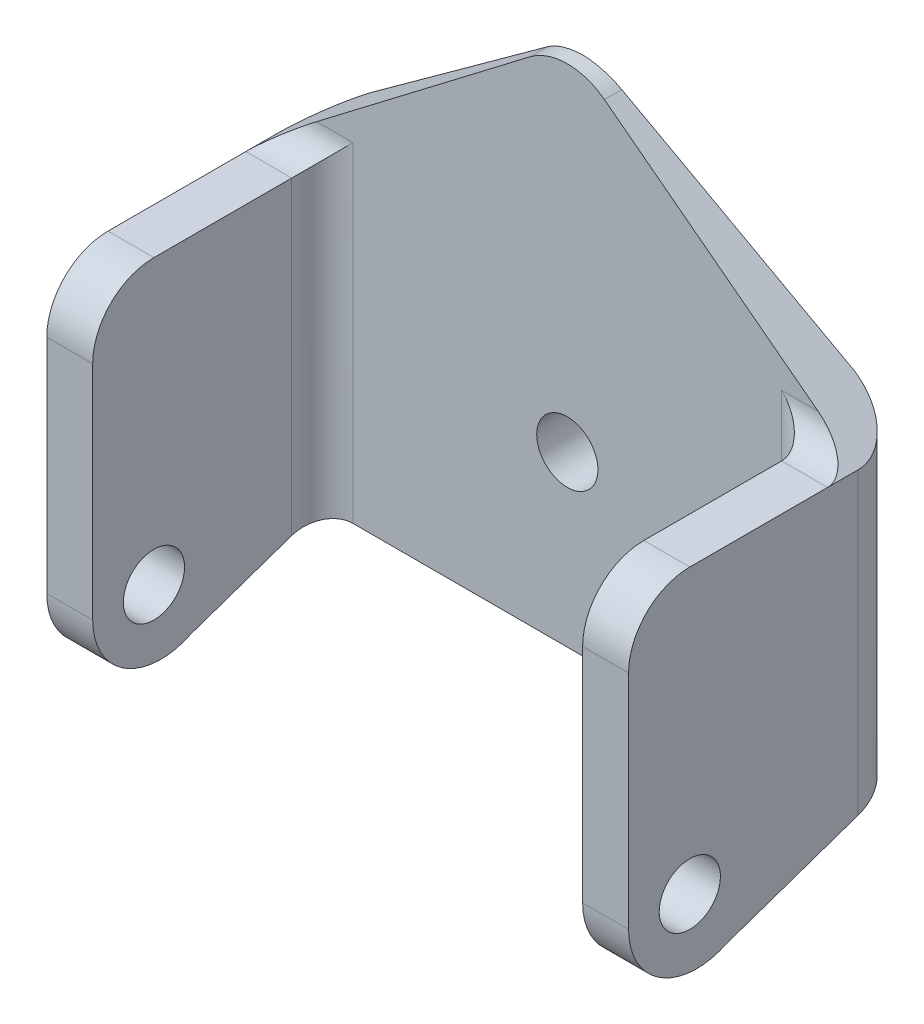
ISO-10303-21;
HEADER;
FILE_DESCRIPTION(('STEP AP214'),'2;1');
FILE_NAME('part.step','',(''),(''),'','','');
FILE_SCHEMA(('AUTOMOTIVE_DESIGN { 1 0 10303 214 1 1 1 1 }'));
ENDSEC;
DATA;
#1=APPLICATION_CONTEXT('core data for automotive mechanical design processes');
#2=APPLICATION_PROTOCOL_DEFINITION('international standard','automotive_design',2000,#1);
#3=PRODUCT_CONTEXT('',#1,'mechanical');
#4=PRODUCT('Part','Part','',(#3));
#5=PRODUCT_RELATED_PRODUCT_CATEGORY('part','',(#4));
#6=PRODUCT_DEFINITION_FORMATION('','',#4);
#7=PRODUCT_DEFINITION_CONTEXT('part definition',#1,'design');
#8=PRODUCT_DEFINITION('design','',#6,#7);
#9=PRODUCT_DEFINITION_SHAPE('','',#8);
#10=(LENGTH_UNIT() NAMED_UNIT(*) SI_UNIT(.MILLI.,.METRE.));
#11=(NAMED_UNIT(*) PLANE_ANGLE_UNIT() SI_UNIT($,.RADIAN.));
#12=(NAMED_UNIT(*) SI_UNIT($,.STERADIAN.) SOLID_ANGLE_UNIT());
#13=UNCERTAINTY_MEASURE_WITH_UNIT(LENGTH_MEASURE(1.E-05),#10,'distance_accuracy_value','');
#14=(GEOMETRIC_REPRESENTATION_CONTEXT(3) GLOBAL_UNCERTAINTY_ASSIGNED_CONTEXT((#13)) GLOBAL_UNIT_ASSIGNED_CONTEXT((#10,
#11,#12)) REPRESENTATION_CONTEXT('',''));
#15=CARTESIAN_POINT('',(0.,0.,0.));
#16=DIRECTION('',(0.,0.,1.));
#17=DIRECTION('',(1.,0.,0.));
#18=AXIS2_PLACEMENT_3D('',#15,#16,#17);
#19=CARTESIAN_POINT('',(16.,4.49999999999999,11.));
#20=DIRECTION('',(1.,0.,0.));
#21=DIRECTION('',(0.,1.,0.));
#22=AXIS2_PLACEMENT_3D('',#19,#20,#21);
#23=PLANE('',#22);
#24=CARTESIAN_POINT('',(16.,-10.,11.));
#25=DIRECTION('',(1.,0.,0.));
#26=DIRECTION('',(0.,1.,0.));
#27=AXIS2_PLACEMENT_3D('',#24,#25,#26);
#28=CIRCLE('',#27,2.);
#29=CARTESIAN_POINT('',(16.,-8.,11.));
#30=VERTEX_POINT('',#29);
#31=EDGE_CURVE('E268',#30,#30,#28,.T.);
#32=ORIENTED_EDGE('',*,*,#31,.T.);
#33=EDGE_LOOP('',(#32));
#34=FACE_BOUND('',#33,.T.);
#35=DIRECTION('',(0.,0.,1.));
#36=VECTOR('',#35,1.);
#37=CARTESIAN_POINT('',(16.,8.49999999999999,-3.));
#38=LINE('',#37,#36);
#39=CARTESIAN_POINT('',(16.,8.49999999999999,2.));
#40=VERTEX_POINT('',#39);
#41=CARTESIAN_POINT('',(16.,8.49999999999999,11.));
#42=VERTEX_POINT('',#41);
#43=EDGE_CURVE('E296',#40,#42,#38,.T.);
#44=ORIENTED_EDGE('',*,*,#43,.F.);
#45=DIRECTION('',(0.,-1.,0.));
#46=VECTOR('',#45,1.);
#47=CARTESIAN_POINT('',(16.,-11.0351212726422,2.));
#48=LINE('',#47,#46);
#49=CARTESIAN_POINT('',(16.,-11.7252021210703,2.));
#50=VERTEX_POINT('',#49);
#51=EDGE_CURVE('E324',#40,#50,#48,.T.);
#52=ORIENTED_EDGE('',*,*,#51,.T.);
#53=DIRECTION('',(0.,0.326170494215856,-0.945310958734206));
#54=VECTOR('',#53,1.);
#55=CARTESIAN_POINT('',(16.,-10.,-3.));
#56=LINE('',#55,#54);
#57=CARTESIAN_POINT('',(16.,-14.,8.59284454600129));
#58=VERTEX_POINT('',#57);
#59=EDGE_CURVE('E293',#58,#50,#56,.T.);
#60=ORIENTED_EDGE('',*,*,#59,.F.);
#61=CARTESIAN_POINT('',(16.,-10.,10.5478182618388));
#62=DIRECTION('',(1.,0.,0.));
#63=DIRECTION('',(0.,1.,0.));
#64=AXIS2_PLACEMENT_3D('',#61,#62,#63);
#65=CIRCLE('',#64,4.45218173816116);
#66=CARTESIAN_POINT('',(16.,-10.,15.));
#67=VERTEX_POINT('',#66);
#68=EDGE_CURVE('E290',#67,#58,#65,.T.);
#69=ORIENTED_EDGE('',*,*,#68,.F.);
#70=DIRECTION('',(0.,-1.,0.));
#71=VECTOR('',#70,1.);
#72=CARTESIAN_POINT('',(16.,4.49999999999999,15.));
#73=LINE('',#72,#71);
#74=CARTESIAN_POINT('',(16.,4.49999999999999,15.));
#75=VERTEX_POINT('',#74);
#76=EDGE_CURVE('E287',#75,#67,#73,.T.);
#77=ORIENTED_EDGE('',*,*,#76,.F.);
#78=CARTESIAN_POINT('',(16.,4.49999999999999,11.));
#79=DIRECTION('',(1.,0.,0.));
#80=DIRECTION('',(0.,1.,0.));
#81=AXIS2_PLACEMENT_3D('',#78,#79,#80);
#82=CIRCLE('',#81,4.);
#83=EDGE_CURVE('E284',#42,#75,#82,.T.);
#84=ORIENTED_EDGE('',*,*,#83,.F.);
#85=EDGE_LOOP('',(#44,#52,#60,#69,#77,#84));
#86=FACE_BOUND('',#85,.T.);
#87=ADVANCED_FACE('F32',(#34,#86),#23,.F.);
#88=CARTESIAN_POINT('',(0.,0.,-3.));
#89=DIRECTION('',(0.,0.,1.));
#90=DIRECTION('',(1.,0.,0.));
#91=AXIS2_PLACEMENT_3D('',#88,#89,#90);
#92=CYLINDRICAL_SURFACE('',#91,2.);
#93=CARTESIAN_POINT('',(0.,0.,0.));
#94=DIRECTION('',(0.,0.,-1.));
#95=DIRECTION('',(-1.,0.,0.));
#96=AXIS2_PLACEMENT_3D('',#93,#94,#95);
#97=CIRCLE('',#96,2.);
#98=CARTESIAN_POINT('',(-2.,0.,0.));
#99=VERTEX_POINT('',#98);
#100=EDGE_CURVE('E301',#99,#99,#97,.T.);
#101=ORIENTED_EDGE('',*,*,#100,.F.);
#102=EDGE_LOOP('',(#101));
#103=FACE_BOUND('',#102,.T.);
#104=CARTESIAN_POINT('',(0.,0.,-3.));
#105=DIRECTION('',(0.,0.,-1.));
#106=DIRECTION('',(-1.,0.,0.));
#107=AXIS2_PLACEMENT_3D('',#104,#105,#106);
#108=CIRCLE('',#107,2.);
#109=CARTESIAN_POINT('',(-2.,0.,-3.));
#110=VERTEX_POINT('',#109);
#111=EDGE_CURVE('E311',#110,#110,#108,.T.);
#112=ORIENTED_EDGE('',*,*,#111,.T.);
#113=EDGE_LOOP('',(#112));
#114=FACE_BOUND('',#113,.T.);
#115=ADVANCED_FACE('F34',(#103,#114),#92,.F.);
#116=CARTESIAN_POINT('',(0.,23.,-3.));
#117=DIRECTION('',(0.606673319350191,0.794951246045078,0.));
#118=DIRECTION('',(-0.794951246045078,0.606673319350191,0.));
#119=AXIS2_PLACEMENT_3D('',#116,#117,#118);
#120=PLANE('',#119);
#121=DIRECTION('',(0.790080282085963,-0.602956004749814,-0.11053146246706));
#122=VECTOR('',#121,1.);
#123=CARTESIAN_POINT('',(0.192613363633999,22.8530055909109,-0.821333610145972));
#124=LINE('',#123,#122);
#125=CARTESIAN_POINT('',(2.42669327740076,21.1480498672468,-1.13387921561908));
#126=VERTEX_POINT('',#125);
#127=CARTESIAN_POINT('',(15.7657480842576,10.9682448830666,-3.));
#128=VERTEX_POINT('',#127);
#129=EDGE_CURVE('E196',#126,#128,#124,.T.);
#130=ORIENTED_EDGE('',*,*,#129,.F.);
#131=DIRECTION('',(0.,0.,1.));
#132=VECTOR('',#131,1.);
#133=CARTESIAN_POINT('',(2.42669327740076,21.1480498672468,-3.));
#134=LINE('',#133,#132);
#135=CARTESIAN_POINT('',(2.42669327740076,21.1480498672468,0.));
#136=VERTEX_POINT('',#135);
#137=EDGE_CURVE('E194',#126,#136,#134,.T.);
#138=ORIENTED_EDGE('',*,*,#137,.T.);
#139=DIRECTION('',(-0.794951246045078,0.606673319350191,0.));
#140=VECTOR('',#139,1.);
#141=CARTESIAN_POINT('',(0.,23.,0.));
#142=LINE('',#141,#140);
#143=CARTESIAN_POINT('',(16.3793103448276,10.5,0.));
#144=VERTEX_POINT('',#143);
#145=EDGE_CURVE('E309',#144,#136,#142,.T.);
#146=ORIENTED_EDGE('',*,*,#145,.F.);
#147=CARTESIAN_POINT('',(16.3793103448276,10.5,2.));
#148=DIRECTION('',(0.606673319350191,0.794951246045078,0.));
#149=DIRECTION('',(0.794951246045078,-0.606673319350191,0.));
#150=AXIS2_PLACEMENT_3D('',#147,#148,#149);
#151=ELLIPSE('',#150,3.29666714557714,2.);
#152=CARTESIAN_POINT('',(19.,8.49999999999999,2.));
#153=VERTEX_POINT('',#152);
#154=EDGE_CURVE('E373',#144,#153,#151,.F.);
#155=ORIENTED_EDGE('',*,*,#154,.T.);
#156=DIRECTION('',(0.,0.,1.));
#157=VECTOR('',#156,1.);
#158=CARTESIAN_POINT('',(19.,8.5,-3.));
#159=LINE('',#158,#157);
#160=CARTESIAN_POINT('',(19.,8.49999999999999,0.));
#161=VERTEX_POINT('',#160);
#162=EDGE_CURVE('E187',#161,#153,#159,.T.);
#163=ORIENTED_EDGE('',*,*,#162,.F.);
#164=CARTESIAN_POINT('',(16.,10.7894736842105,0.));
#165=DIRECTION('',(0.606673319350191,0.794951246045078,0.));
#166=DIRECTION('',(-0.794951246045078,0.606673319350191,0.));
#167=AXIS2_PLACEMENT_3D('',#164,#165,#166);
#168=ELLIPSE('',#167,3.77381633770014,3.);
#169=CARTESIAN_POINT('',(16.,10.7894736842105,-3.));
#170=VERTEX_POINT('',#169);
#171=EDGE_CURVE('E356',#161,#170,#168,.T.);
#172=ORIENTED_EDGE('',*,*,#171,.T.);
#173=DIRECTION('',(-0.794951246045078,0.606673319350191,0.));
#174=VECTOR('',#173,1.);
#175=CARTESIAN_POINT('',(0.,23.,-3.));
#176=LINE('',#175,#174);
#177=EDGE_CURVE('E204',#170,#128,#176,.T.);
#178=ORIENTED_EDGE('',*,*,#177,.T.);
#179=EDGE_LOOP('',(#130,#138,#146,#155,#163,#172,#178));
#180=FACE_BOUND('',#179,.T.);
#181=ADVANCED_FACE('F200',(#180),#120,.T.);
#182=CARTESIAN_POINT('',(19.,-10.,-3.));
#183=DIRECTION('',(1.,0.,0.));
#184=DIRECTION('',(0.,1.,0.));
#185=AXIS2_PLACEMENT_3D('',#182,#183,#184);
#186=PLANE('',#185);
#187=DIRECTION('',(0.,0.326170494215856,-0.945310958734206));
#188=VECTOR('',#187,1.);
#189=CARTESIAN_POINT('',(19.,-10.,-3.));
#190=LINE('',#189,#188);
#191=CARTESIAN_POINT('',(19.,-14.,8.59284454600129));
#192=VERTEX_POINT('',#191);
#193=CARTESIAN_POINT('',(19.,-11.0351212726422,0.));
#194=VERTEX_POINT('',#193);
#195=EDGE_CURVE('E280',#192,#194,#190,.T.);
#196=ORIENTED_EDGE('',*,*,#195,.T.);
#197=DIRECTION('',(0.,1.,0.));
#198=VECTOR('',#197,1.);
#199=CARTESIAN_POINT('',(19.,-10.,0.));
#200=LINE('',#199,#198);
#201=EDGE_CURVE('E353',#194,#161,#200,.T.);
#202=ORIENTED_EDGE('',*,*,#201,.T.);
#203=ORIENTED_EDGE('',*,*,#162,.T.);
#204=DIRECTION('',(0.,0.,1.));
#205=VECTOR('',#204,1.);
#206=CARTESIAN_POINT('',(19.,8.49999999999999,-3.));
#207=LINE('',#206,#205);
#208=CARTESIAN_POINT('',(19.,8.49999999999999,11.));
#209=VERTEX_POINT('',#208);
#210=EDGE_CURVE('E56',#153,#209,#207,.T.);
#211=ORIENTED_EDGE('',*,*,#210,.T.);
#212=CARTESIAN_POINT('',(19.,4.49999999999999,11.));
#213=DIRECTION('',(1.,0.,0.));
#214=DIRECTION('',(0.,1.,0.));
#215=AXIS2_PLACEMENT_3D('',#212,#213,#214);
#216=CIRCLE('',#215,4.);
#217=CARTESIAN_POINT('',(19.,4.49999999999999,15.));
#218=VERTEX_POINT('',#217);
#219=EDGE_CURVE('E271',#209,#218,#216,.T.);
#220=ORIENTED_EDGE('',*,*,#219,.T.);
#221=DIRECTION('',(0.,-1.,0.));
#222=VECTOR('',#221,1.);
#223=CARTESIAN_POINT('',(19.,4.49999999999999,15.));
#224=LINE('',#223,#222);
#225=CARTESIAN_POINT('',(19.,-10.,15.));
#226=VERTEX_POINT('',#225);
#227=EDGE_CURVE('E274',#218,#226,#224,.T.);
#228=ORIENTED_EDGE('',*,*,#227,.T.);
#229=CARTESIAN_POINT('',(19.,-10.,10.5478182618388));
#230=DIRECTION('',(1.,0.,0.));
#231=DIRECTION('',(0.,1.,0.));
#232=AXIS2_PLACEMENT_3D('',#229,#230,#231);
#233=CIRCLE('',#232,4.45218173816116);
#234=EDGE_CURVE('E277',#226,#192,#233,.T.);
#235=ORIENTED_EDGE('',*,*,#234,.T.);
#236=EDGE_LOOP('',(#196,#202,#203,#211,#220,#228,#235));
#237=FACE_BOUND('',#236,.T.);
#238=CARTESIAN_POINT('',(19.,-10.,11.));
#239=DIRECTION('',(1.,0.,0.));
#240=DIRECTION('',(0.,1.,0.));
#241=AXIS2_PLACEMENT_3D('',#238,#239,#240);
#242=CIRCLE('',#241,2.);
#243=CARTESIAN_POINT('',(19.,-8.,11.));
#244=VERTEX_POINT('',#243);
#245=EDGE_CURVE('E265',#244,#244,#242,.T.);
#246=ORIENTED_EDGE('',*,*,#245,.F.);
#247=EDGE_LOOP('',(#246));
#248=FACE_BOUND('',#247,.T.);
#249=ADVANCED_FACE('F384',(#237,#248),#186,.T.);
#250=CARTESIAN_POINT('',(0.,0.,-3.));
#251=DIRECTION('',(0.,0.,-1.));
#252=DIRECTION('',(-1.,0.,0.));
#253=AXIS2_PLACEMENT_3D('',#250,#251,#252);
#254=PLANE('',#253);
#255=DIRECTION('',(-1.,0.,0.));
#256=VECTOR('',#255,1.);
#257=CARTESIAN_POINT('',(0.,10.9682448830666,-3.));
#258=LINE('',#257,#256);
#259=CARTESIAN_POINT('',(-15.7657480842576,10.9682448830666,-3.));
#260=VERTEX_POINT('',#259);
#261=EDGE_CURVE('E207',#128,#260,#258,.T.);
#262=ORIENTED_EDGE('',*,*,#261,.F.);
#263=ORIENTED_EDGE('',*,*,#177,.F.);
#264=DIRECTION('',(0.,1.,0.));
#265=VECTOR('',#264,1.);
#266=CARTESIAN_POINT('',(16.,0.,-3.));
#267=LINE('',#266,#265);
#268=CARTESIAN_POINT('',(16.,-10.,-3.));
#269=VERTEX_POINT('',#268);
#270=EDGE_CURVE('E339',#170,#269,#267,.F.);
#271=ORIENTED_EDGE('',*,*,#270,.T.);
#272=DIRECTION('',(1.,0.,0.));
#273=VECTOR('',#272,1.);
#274=CARTESIAN_POINT('',(0.,-10.,-3.));
#275=LINE('',#274,#273);
#276=CARTESIAN_POINT('',(-16.,-9.99999999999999,-3.));
#277=VERTEX_POINT('',#276);
#278=EDGE_CURVE('E314',#277,#269,#275,.T.);
#279=ORIENTED_EDGE('',*,*,#278,.F.);
#280=DIRECTION('',(0.,1.,0.));
#281=VECTOR('',#280,1.);
#282=CARTESIAN_POINT('',(-16.,0.,-3.));
#283=LINE('',#282,#281);
#284=CARTESIAN_POINT('',(-16.,10.7894736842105,-3.));
#285=VERTEX_POINT('',#284);
#286=EDGE_CURVE('E341',#277,#285,#283,.T.);
#287=ORIENTED_EDGE('',*,*,#286,.T.);
#288=DIRECTION('',(0.794951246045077,0.606673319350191,0.));
#289=VECTOR('',#288,1.);
#290=CARTESIAN_POINT('',(0.,23.,-3.));
#291=LINE('',#290,#289);
#292=EDGE_CURVE('E259',#285,#260,#291,.T.);
#293=ORIENTED_EDGE('',*,*,#292,.T.);
#294=EDGE_LOOP('',(#262,#263,#271,#279,#287,#293));
#295=FACE_BOUND('',#294,.T.);
#296=ORIENTED_EDGE('',*,*,#111,.F.);
#297=EDGE_LOOP('',(#296));
#298=FACE_BOUND('',#297,.T.);
#299=ADVANCED_FACE('F433',(#295,#298),#254,.T.);
#300=CARTESIAN_POINT('',(0.,0.,0.));
#301=DIRECTION('',(0.,0.,-1.));
#302=DIRECTION('',(-1.,0.,0.));
#303=AXIS2_PLACEMENT_3D('',#300,#301,#302);
#304=PLANE('',#303);
#305=ORIENTED_EDGE('',*,*,#100,.T.);
#306=EDGE_LOOP('',(#305));
#307=FACE_BOUND('',#306,.T.);
#308=DIRECTION('',(0.794951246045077,0.606673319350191,0.));
#309=VECTOR('',#308,1.);
#310=CARTESIAN_POINT('',(0.,23.,0.));
#311=LINE('',#310,#309);
#312=CARTESIAN_POINT('',(-16.3793103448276,10.5,0.));
#313=VERTEX_POINT('',#312);
#314=CARTESIAN_POINT('',(-2.42669327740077,21.1480498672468,0.));
#315=VERTEX_POINT('',#314);
#316=EDGE_CURVE('E252',#313,#315,#311,.T.);
#317=ORIENTED_EDGE('',*,*,#316,.F.);
#318=DIRECTION('',(-1.,0.,0.));
#319=VECTOR('',#318,1.);
#320=CARTESIAN_POINT('',(0.,10.5,0.));
#321=LINE('',#320,#319);
#322=CARTESIAN_POINT('',(-14.,10.5,0.));
#323=VERTEX_POINT('',#322);
#324=EDGE_CURVE('E364',#313,#323,#321,.F.);
#325=ORIENTED_EDGE('',*,*,#324,.T.);
#326=DIRECTION('',(0.,-1.,0.));
#327=VECTOR('',#326,1.);
#328=CARTESIAN_POINT('',(-14.,-11.0351212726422,0.));
#329=LINE('',#328,#327);
#330=CARTESIAN_POINT('',(-14.,-11.0351212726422,0.));
#331=VERTEX_POINT('',#330);
#332=EDGE_CURVE('E327',#323,#331,#329,.T.);
#333=ORIENTED_EDGE('',*,*,#332,.T.);
#334=DIRECTION('',(-1.,0.,0.));
#335=VECTOR('',#334,1.);
#336=CARTESIAN_POINT('',(0.,-11.0351212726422,0.));
#337=LINE('',#336,#335);
#338=CARTESIAN_POINT('',(14.,-11.0351212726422,0.));
#339=VERTEX_POINT('',#338);
#340=EDGE_CURVE('E262',#339,#331,#337,.T.);
#341=ORIENTED_EDGE('',*,*,#340,.F.);
#342=DIRECTION('',(0.,-1.,0.));
#343=VECTOR('',#342,1.);
#344=CARTESIAN_POINT('',(14.,8.49999999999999,0.));
#345=LINE('',#344,#343);
#346=CARTESIAN_POINT('',(14.,10.5,0.));
#347=VERTEX_POINT('',#346);
#348=EDGE_CURVE('E330',#339,#347,#345,.F.);
#349=ORIENTED_EDGE('',*,*,#348,.T.);
#350=DIRECTION('',(1.,0.,0.));
#351=VECTOR('',#350,1.);
#352=CARTESIAN_POINT('',(0.,10.5,0.));
#353=LINE('',#352,#351);
#354=EDGE_CURVE('E361',#347,#144,#353,.T.);
#355=ORIENTED_EDGE('',*,*,#354,.T.);
#356=ORIENTED_EDGE('',*,*,#145,.T.);
#357=CARTESIAN_POINT('',(0.,17.9682448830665,0.));
#358=DIRECTION('',(0.,0.,-1.));
#359=DIRECTION('',(-1.,0.,0.));
#360=AXIS2_PLACEMENT_3D('',#357,#358,#359);
#361=CIRCLE('',#360,4.);
#362=EDGE_CURVE('E319',#136,#315,#361,.F.);
#363=ORIENTED_EDGE('',*,*,#362,.T.);
#364=EDGE_LOOP('',(#317,#325,#333,#341,#349,#355,#356,#363));
#365=FACE_BOUND('',#364,.T.);
#366=ADVANCED_FACE('F408',(#307,#365),#304,.F.);
#367=CARTESIAN_POINT('',(16.,8.49999999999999,-3.));
#368=DIRECTION('',(0.,1.,0.));
#369=DIRECTION('',(-1.,0.,0.));
#370=AXIS2_PLACEMENT_3D('',#367,#368,#369);
#371=PLANE('',#370);
#372=ORIENTED_EDGE('',*,*,#210,.F.);
#373=DIRECTION('',(1.,0.,0.));
#374=VECTOR('',#373,1.);
#375=CARTESIAN_POINT('',(16.,8.49999999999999,2.));
#376=LINE('',#375,#374);
#377=EDGE_CURVE('E367',#153,#40,#376,.F.);
#378=ORIENTED_EDGE('',*,*,#377,.T.);
#379=ORIENTED_EDGE('',*,*,#43,.T.);
#380=DIRECTION('',(1.,0.,0.));
#381=VECTOR('',#380,1.);
#382=CARTESIAN_POINT('',(16.,8.49999999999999,11.));
#383=LINE('',#382,#381);
#384=EDGE_CURVE('E299',#42,#209,#383,.T.);
#385=ORIENTED_EDGE('',*,*,#384,.T.);
#386=EDGE_LOOP('',(#372,#378,#379,#385));
#387=FACE_BOUND('',#386,.T.);
#388=ADVANCED_FACE('F393',(#387),#371,.T.);
#389=CARTESIAN_POINT('',(16.,4.49999999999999,11.));
#390=DIRECTION('',(1.,0.,0.));
#391=DIRECTION('',(0.,1.,0.));
#392=AXIS2_PLACEMENT_3D('',#389,#390,#391);
#393=CYLINDRICAL_SURFACE('',#392,4.);
#394=ORIENTED_EDGE('',*,*,#219,.F.);
#395=ORIENTED_EDGE('',*,*,#384,.F.);
#396=ORIENTED_EDGE('',*,*,#83,.T.);
#397=DIRECTION('',(1.,0.,0.));
#398=VECTOR('',#397,1.);
#399=CARTESIAN_POINT('',(16.,4.49999999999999,15.));
#400=LINE('',#399,#398);
#401=EDGE_CURVE('E298',#75,#218,#400,.T.);
#402=ORIENTED_EDGE('',*,*,#401,.T.);
#403=EDGE_LOOP('',(#394,#395,#396,#402));
#404=FACE_BOUND('',#403,.T.);
#405=ADVANCED_FACE('F476',(#404),#393,.T.);
#406=CARTESIAN_POINT('',(16.,-10.,-3.));
#407=DIRECTION('',(0.,-0.945310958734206,-0.326170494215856));
#408=DIRECTION('',(0.,0.326170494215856,-0.945310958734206));
#409=AXIS2_PLACEMENT_3D('',#406,#407,#408);
#410=PLANE('',#409);
#411=DIRECTION('',(0.,0.326170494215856,-0.945310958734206));
#412=VECTOR('',#411,1.);
#413=CARTESIAN_POINT('',(-19.,-10.,-3.));
#414=LINE('',#413,#412);
#415=CARTESIAN_POINT('',(-19.,-14.,8.59284454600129));
#416=VERTEX_POINT('',#415);
#417=CARTESIAN_POINT('',(-19.,-11.0351212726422,0.));
#418=VERTEX_POINT('',#417);
#419=EDGE_CURVE('E229',#416,#418,#414,.T.);
#420=ORIENTED_EDGE('',*,*,#419,.T.);
#421=CARTESIAN_POINT('',(-16.,-11.0351212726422,0.));
#422=DIRECTION('',(0.,-0.945310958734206,-0.326170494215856));
#423=DIRECTION('',(0.,0.326170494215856,-0.945310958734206));
#424=AXIS2_PLACEMENT_3D('',#421,#422,#423);
#425=ELLIPSE('',#424,3.17355889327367,3.);
#426=EDGE_CURVE('E351',#418,#277,#425,.T.);
#427=ORIENTED_EDGE('',*,*,#426,.T.);
#428=ORIENTED_EDGE('',*,*,#278,.T.);
#429=CARTESIAN_POINT('',(16.,-11.0351212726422,0.));
#430=DIRECTION('',(0.,-0.945310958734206,-0.326170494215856));
#431=DIRECTION('',(0.,0.326170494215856,-0.945310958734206));
#432=AXIS2_PLACEMENT_3D('',#429,#430,#431);
#433=ELLIPSE('',#432,3.17355889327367,3.);
#434=EDGE_CURVE('E349',#269,#194,#433,.T.);
#435=ORIENTED_EDGE('',*,*,#434,.T.);
#436=ORIENTED_EDGE('',*,*,#195,.F.);
#437=DIRECTION('',(1.,0.,0.));
#438=VECTOR('',#437,1.);
#439=CARTESIAN_POINT('',(16.,-14.,8.59284454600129));
#440=LINE('',#439,#438);
#441=EDGE_CURVE('E302',#58,#192,#440,.T.);
#442=ORIENTED_EDGE('',*,*,#441,.F.);
#443=ORIENTED_EDGE('',*,*,#59,.T.);
#444=CARTESIAN_POINT('',(14.,-11.7252021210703,2.));
#445=DIRECTION('',(0.,-0.945310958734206,-0.326170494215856));
#446=DIRECTION('',(0.,0.326170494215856,-0.945310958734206));
#447=AXIS2_PLACEMENT_3D('',#444,#445,#446);
#448=ELLIPSE('',#447,2.11570592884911,2.);
#449=EDGE_CURVE('E335',#50,#339,#448,.F.);
#450=ORIENTED_EDGE('',*,*,#449,.T.);
#451=ORIENTED_EDGE('',*,*,#340,.T.);
#452=CARTESIAN_POINT('',(-14.,-11.7252021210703,2.));
#453=DIRECTION('',(0.,-0.945310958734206,-0.326170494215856));
#454=DIRECTION('',(0.,0.326170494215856,-0.945310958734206));
#455=AXIS2_PLACEMENT_3D('',#452,#453,#454);
#456=ELLIPSE('',#455,2.11570592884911,2.);
#457=CARTESIAN_POINT('',(-16.,-11.7252021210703,2.));
#458=VERTEX_POINT('',#457);
#459=EDGE_CURVE('E337',#331,#458,#456,.F.);
#460=ORIENTED_EDGE('',*,*,#459,.T.);
#461=DIRECTION('',(0.,0.326170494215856,-0.945310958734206));
#462=VECTOR('',#461,1.);
#463=CARTESIAN_POINT('',(-16.,-10.,-3.));
#464=LINE('',#463,#462);
#465=CARTESIAN_POINT('',(-16.,-14.,8.59284454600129));
#466=VERTEX_POINT('',#465);
#467=EDGE_CURVE('E243',#466,#458,#464,.T.);
#468=ORIENTED_EDGE('',*,*,#467,.F.);
#469=DIRECTION('',(-1.,0.,0.));
#470=VECTOR('',#469,1.);
#471=CARTESIAN_POINT('',(-16.,-14.,8.59284454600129));
#472=LINE('',#471,#470);
#473=EDGE_CURVE('E253',#466,#416,#472,.T.);
#474=ORIENTED_EDGE('',*,*,#473,.T.);
#475=EDGE_LOOP('',(#420,#427,#428,#435,#436,#442,#443,#450,#451,#460,#468,#474));
#476=FACE_BOUND('',#475,.T.);
#477=ADVANCED_FACE('F405',(#476),#410,.T.);
#478=CARTESIAN_POINT('',(16.,-10.,10.5478182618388));
#479=DIRECTION('',(1.,0.,0.));
#480=DIRECTION('',(0.,1.,0.));
#481=AXIS2_PLACEMENT_3D('',#478,#479,#480);
#482=CYLINDRICAL_SURFACE('',#481,4.45218173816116);
#483=ORIENTED_EDGE('',*,*,#234,.F.);
#484=DIRECTION('',(1.,0.,0.));
#485=VECTOR('',#484,1.);
#486=CARTESIAN_POINT('',(16.,-10.,15.));
#487=LINE('',#486,#485);
#488=EDGE_CURVE('E304',#67,#226,#487,.T.);
#489=ORIENTED_EDGE('',*,*,#488,.F.);
#490=ORIENTED_EDGE('',*,*,#68,.T.);
#491=ORIENTED_EDGE('',*,*,#441,.T.);
#492=EDGE_LOOP('',(#483,#489,#490,#491));
#493=FACE_BOUND('',#492,.T.);
#494=ADVANCED_FACE('F479',(#493),#482,.T.);
#495=CARTESIAN_POINT('',(16.,4.49999999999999,15.));
#496=DIRECTION('',(0.,0.,1.));
#497=DIRECTION('',(0.,-1.,0.));
#498=AXIS2_PLACEMENT_3D('',#495,#496,#497);
#499=PLANE('',#498);
#500=ORIENTED_EDGE('',*,*,#227,.F.);
#501=ORIENTED_EDGE('',*,*,#401,.F.);
#502=ORIENTED_EDGE('',*,*,#76,.T.);
#503=ORIENTED_EDGE('',*,*,#488,.T.);
#504=EDGE_LOOP('',(#500,#501,#502,#503));
#505=FACE_BOUND('',#504,.T.);
#506=ADVANCED_FACE('F482',(#505),#499,.T.);
#507=CARTESIAN_POINT('',(16.,-10.,11.));
#508=DIRECTION('',(1.,0.,0.));
#509=DIRECTION('',(0.,1.,0.));
#510=AXIS2_PLACEMENT_3D('',#507,#508,#509);
#511=CYLINDRICAL_SURFACE('',#510,2.);
#512=ORIENTED_EDGE('',*,*,#31,.F.);
#513=EDGE_LOOP('',(#512));
#514=FACE_BOUND('',#513,.T.);
#515=ORIENTED_EDGE('',*,*,#245,.T.);
#516=EDGE_LOOP('',(#515));
#517=FACE_BOUND('',#516,.T.);
#518=ADVANCED_FACE('F472',(#514,#517),#511,.F.);
#519=CARTESIAN_POINT('',(-16.,4.49999999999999,11.));
#520=DIRECTION('',(-1.,0.,0.));
#521=DIRECTION('',(0.,1.,0.));
#522=AXIS2_PLACEMENT_3D('',#519,#520,#521);
#523=PLANE('',#522);
#524=CARTESIAN_POINT('',(-16.,-10.,11.));
#525=DIRECTION('',(1.,0.,0.));
#526=DIRECTION('',(0.,1.,0.));
#527=AXIS2_PLACEMENT_3D('',#524,#525,#526);
#528=CIRCLE('',#527,2.);
#529=CARTESIAN_POINT('',(-16.,-8.00000000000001,11.));
#530=VERTEX_POINT('',#529);
#531=EDGE_CURVE('E213',#530,#530,#528,.T.);
#532=ORIENTED_EDGE('',*,*,#531,.F.);
#533=EDGE_LOOP('',(#532));
#534=FACE_BOUND('',#533,.T.);
#535=ORIENTED_EDGE('',*,*,#467,.T.);
#536=DIRECTION('',(0.,-1.,0.));
#537=VECTOR('',#536,1.);
#538=CARTESIAN_POINT('',(-16.,8.49999999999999,2.));
#539=LINE('',#538,#537);
#540=CARTESIAN_POINT('',(-16.,8.49999999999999,2.));
#541=VERTEX_POINT('',#540);
#542=EDGE_CURVE('E332',#458,#541,#539,.F.);
#543=ORIENTED_EDGE('',*,*,#542,.T.);
#544=DIRECTION('',(0.,0.,1.));
#545=VECTOR('',#544,1.);
#546=CARTESIAN_POINT('',(-16.,8.49999999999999,-3.));
#547=LINE('',#546,#545);
#548=CARTESIAN_POINT('',(-16.,8.49999999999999,11.));
#549=VERTEX_POINT('',#548);
#550=EDGE_CURVE('E246',#541,#549,#547,.T.);
#551=ORIENTED_EDGE('',*,*,#550,.T.);
#552=CARTESIAN_POINT('',(-16.,4.49999999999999,11.));
#553=DIRECTION('',(1.,0.,0.));
#554=DIRECTION('',(0.,1.,0.));
#555=AXIS2_PLACEMENT_3D('',#552,#553,#554);
#556=CIRCLE('',#555,4.);
#557=CARTESIAN_POINT('',(-16.,4.49999999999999,15.));
#558=VERTEX_POINT('',#557);
#559=EDGE_CURVE('E234',#549,#558,#556,.T.);
#560=ORIENTED_EDGE('',*,*,#559,.T.);
#561=DIRECTION('',(0.,-1.,0.));
#562=VECTOR('',#561,1.);
#563=CARTESIAN_POINT('',(-16.,4.49999999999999,15.));
#564=LINE('',#563,#562);
#565=CARTESIAN_POINT('',(-16.,-10.,15.));
#566=VERTEX_POINT('',#565);
#567=EDGE_CURVE('E237',#558,#566,#564,.T.);
#568=ORIENTED_EDGE('',*,*,#567,.T.);
#569=CARTESIAN_POINT('',(-16.,-10.,10.5478182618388));
#570=DIRECTION('',(1.,0.,0.));
#571=DIRECTION('',(0.,1.,0.));
#572=AXIS2_PLACEMENT_3D('',#569,#570,#571);
#573=CIRCLE('',#572,4.45218173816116);
#574=EDGE_CURVE('E240',#566,#466,#573,.T.);
#575=ORIENTED_EDGE('',*,*,#574,.T.);
#576=EDGE_LOOP('',(#535,#543,#551,#560,#568,#575));
#577=FACE_BOUND('',#576,.T.);
#578=ADVANCED_FACE('F416',(#534,#577),#523,.F.);
#579=CARTESIAN_POINT('',(0.,23.,-3.));
#580=DIRECTION('',(-0.606673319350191,0.794951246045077,0.));
#581=DIRECTION('',(0.794951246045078,0.606673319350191,0.));
#582=AXIS2_PLACEMENT_3D('',#579,#580,#581);
#583=PLANE('',#582);
#584=DIRECTION('',(0.790080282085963,0.602956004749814,0.11053146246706));
#585=VECTOR('',#584,1.);
#586=CARTESIAN_POINT('',(-0.192613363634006,22.8530055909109,-0.821333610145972));
#587=LINE('',#586,#585);
#588=CARTESIAN_POINT('',(-2.42669327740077,21.1480498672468,-1.13387921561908));
#589=VERTEX_POINT('',#588);
#590=EDGE_CURVE('E48',#260,#589,#587,.T.);
#591=ORIENTED_EDGE('',*,*,#590,.F.);
#592=ORIENTED_EDGE('',*,*,#292,.F.);
#593=CARTESIAN_POINT('',(-16.,10.7894736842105,0.));
#594=DIRECTION('',(-0.606673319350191,0.794951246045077,0.));
#595=DIRECTION('',(0.794951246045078,0.606673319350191,0.));
#596=AXIS2_PLACEMENT_3D('',#593,#594,#595);
#597=ELLIPSE('',#596,3.77381633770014,3.);
#598=CARTESIAN_POINT('',(-19.,8.49999999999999,0.));
#599=VERTEX_POINT('',#598);
#600=EDGE_CURVE('E344',#285,#599,#597,.T.);
#601=ORIENTED_EDGE('',*,*,#600,.T.);
#602=DIRECTION('',(0.,0.,1.));
#603=VECTOR('',#602,1.);
#604=CARTESIAN_POINT('',(-19.,8.49999999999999,-3.));
#605=LINE('',#604,#603);
#606=CARTESIAN_POINT('',(-19.,8.49999999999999,1.99999699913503));
#607=VERTEX_POINT('',#606);
#608=EDGE_CURVE('E378',#599,#607,#605,.T.);
#609=ORIENTED_EDGE('',*,*,#608,.T.);
#610=CARTESIAN_POINT('',(-16.3793103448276,10.5,2.));
#611=DIRECTION('',(-0.606673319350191,0.794951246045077,0.));
#612=DIRECTION('',(-0.794951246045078,-0.606673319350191,0.));
#613=AXIS2_PLACEMENT_3D('',#610,#611,#612);
#614=ELLIPSE('',#613,3.29666714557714,2.);
#615=EDGE_CURVE('E369',#607,#313,#614,.F.);
#616=ORIENTED_EDGE('',*,*,#615,.T.);
#617=ORIENTED_EDGE('',*,*,#316,.T.);
#618=DIRECTION('',(0.,0.,1.));
#619=VECTOR('',#618,1.);
#620=CARTESIAN_POINT('',(-2.42669327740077,21.1480498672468,-3.));
#621=LINE('',#620,#619);
#622=EDGE_CURVE('E322',#315,#589,#621,.F.);
#623=ORIENTED_EDGE('',*,*,#622,.T.);
#624=EDGE_LOOP('',(#591,#592,#601,#609,#616,#617,#623));
#625=FACE_BOUND('',#624,.T.);
#626=ADVANCED_FACE('F436',(#625),#583,.T.);
#627=CARTESIAN_POINT('',(-19.,-10.,-3.));
#628=DIRECTION('',(-1.,0.,0.));
#629=DIRECTION('',(0.,1.,0.));
#630=AXIS2_PLACEMENT_3D('',#627,#628,#629);
#631=PLANE('',#630);
#632=DIRECTION('',(0.,0.,1.));
#633=VECTOR('',#632,1.);
#634=CARTESIAN_POINT('',(-19.,8.49999999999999,-3.));
#635=LINE('',#634,#633);
#636=CARTESIAN_POINT('',(-19.,8.49999999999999,11.));
#637=VERTEX_POINT('',#636);
#638=EDGE_CURVE('E232',#607,#637,#635,.T.);
#639=ORIENTED_EDGE('',*,*,#638,.F.);
#640=ORIENTED_EDGE('',*,*,#608,.F.);
#641=DIRECTION('',(0.,1.,0.));
#642=VECTOR('',#641,1.);
#643=CARTESIAN_POINT('',(-19.,-10.,0.));
#644=LINE('',#643,#642);
#645=EDGE_CURVE('E347',#599,#418,#644,.F.);
#646=ORIENTED_EDGE('',*,*,#645,.T.);
#647=ORIENTED_EDGE('',*,*,#419,.F.);
#648=CARTESIAN_POINT('',(-19.,-10.,10.5478182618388));
#649=DIRECTION('',(1.,0.,0.));
#650=DIRECTION('',(0.,1.,0.));
#651=AXIS2_PLACEMENT_3D('',#648,#649,#650);
#652=CIRCLE('',#651,4.45218173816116);
#653=CARTESIAN_POINT('',(-19.,-10.,15.));
#654=VERTEX_POINT('',#653);
#655=EDGE_CURVE('E226',#654,#416,#652,.T.);
#656=ORIENTED_EDGE('',*,*,#655,.F.);
#657=DIRECTION('',(0.,-1.,0.));
#658=VECTOR('',#657,1.);
#659=CARTESIAN_POINT('',(-19.,4.49999999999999,15.));
#660=LINE('',#659,#658);
#661=CARTESIAN_POINT('',(-19.,4.49999999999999,15.));
#662=VERTEX_POINT('',#661);
#663=EDGE_CURVE('E223',#662,#654,#660,.T.);
#664=ORIENTED_EDGE('',*,*,#663,.F.);
#665=CARTESIAN_POINT('',(-19.,4.49999999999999,11.));
#666=DIRECTION('',(1.,0.,0.));
#667=DIRECTION('',(0.,1.,0.));
#668=AXIS2_PLACEMENT_3D('',#665,#666,#667);
#669=CIRCLE('',#668,4.);
#670=EDGE_CURVE('E220',#637,#662,#669,.T.);
#671=ORIENTED_EDGE('',*,*,#670,.F.);
#672=EDGE_LOOP('',(#639,#640,#646,#647,#656,#664,#671));
#673=FACE_BOUND('',#672,.T.);
#674=CARTESIAN_POINT('',(-19.,-10.,11.));
#675=DIRECTION('',(1.,0.,0.));
#676=DIRECTION('',(0.,1.,0.));
#677=AXIS2_PLACEMENT_3D('',#674,#675,#676);
#678=CIRCLE('',#677,2.);
#679=CARTESIAN_POINT('',(-19.,-8.00000000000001,11.));
#680=VERTEX_POINT('',#679);
#681=EDGE_CURVE('E206',#680,#680,#678,.T.);
#682=ORIENTED_EDGE('',*,*,#681,.T.);
#683=EDGE_LOOP('',(#682));
#684=FACE_BOUND('',#683,.T.);
#685=ADVANCED_FACE('F445',(#673,#684),#631,.T.);
#686=CARTESIAN_POINT('',(-16.,8.49999999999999,-3.));
#687=DIRECTION('',(0.,1.,0.));
#688=DIRECTION('',(1.,0.,0.));
#689=AXIS2_PLACEMENT_3D('',#686,#687,#688);
#690=PLANE('',#689);
#691=ORIENTED_EDGE('',*,*,#550,.F.);
#692=DIRECTION('',(-1.,0.,0.));
#693=VECTOR('',#692,1.);
#694=CARTESIAN_POINT('',(-16.,8.49999999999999,2.));
#695=LINE('',#694,#693);
#696=EDGE_CURVE('E358',#541,#607,#695,.T.);
#697=ORIENTED_EDGE('',*,*,#696,.T.);
#698=ORIENTED_EDGE('',*,*,#638,.T.);
#699=DIRECTION('',(-1.,0.,0.));
#700=VECTOR('',#699,1.);
#701=CARTESIAN_POINT('',(-16.,8.49999999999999,11.));
#702=LINE('',#701,#700);
#703=EDGE_CURVE('E249',#549,#637,#702,.T.);
#704=ORIENTED_EDGE('',*,*,#703,.F.);
#705=EDGE_LOOP('',(#691,#697,#698,#704));
#706=FACE_BOUND('',#705,.T.);
#707=ADVANCED_FACE('F442',(#706),#690,.T.);
#708=CARTESIAN_POINT('',(-16.,4.49999999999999,11.));
#709=DIRECTION('',(-1.,0.,0.));
#710=DIRECTION('',(0.,1.,0.));
#711=AXIS2_PLACEMENT_3D('',#708,#709,#710);
#712=CYLINDRICAL_SURFACE('',#711,4.);
#713=ORIENTED_EDGE('',*,*,#670,.T.);
#714=DIRECTION('',(-1.,0.,0.));
#715=VECTOR('',#714,1.);
#716=CARTESIAN_POINT('',(-16.,4.49999999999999,15.));
#717=LINE('',#716,#715);
#718=EDGE_CURVE('E248',#558,#662,#717,.T.);
#719=ORIENTED_EDGE('',*,*,#718,.F.);
#720=ORIENTED_EDGE('',*,*,#559,.F.);
#721=ORIENTED_EDGE('',*,*,#703,.T.);
#722=EDGE_LOOP('',(#713,#719,#720,#721));
#723=FACE_BOUND('',#722,.T.);
#724=ADVANCED_FACE('F449',(#723),#712,.T.);
#725=CARTESIAN_POINT('',(-16.,-10.,10.5478182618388));
#726=DIRECTION('',(-1.,0.,0.));
#727=DIRECTION('',(0.,1.,0.));
#728=AXIS2_PLACEMENT_3D('',#725,#726,#727);
#729=CYLINDRICAL_SURFACE('',#728,4.45218173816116);
#730=ORIENTED_EDGE('',*,*,#655,.T.);
#731=ORIENTED_EDGE('',*,*,#473,.F.);
#732=ORIENTED_EDGE('',*,*,#574,.F.);
#733=DIRECTION('',(-1.,0.,0.));
#734=VECTOR('',#733,1.);
#735=CARTESIAN_POINT('',(-16.,-10.,15.));
#736=LINE('',#735,#734);
#737=EDGE_CURVE('E255',#566,#654,#736,.T.);
#738=ORIENTED_EDGE('',*,*,#737,.T.);
#739=EDGE_LOOP('',(#730,#731,#732,#738));
#740=FACE_BOUND('',#739,.T.);
#741=ADVANCED_FACE('F421',(#740),#729,.T.);
#742=CARTESIAN_POINT('',(-16.,4.49999999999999,15.));
#743=DIRECTION('',(0.,0.,1.));
#744=DIRECTION('',(0.,-1.,0.));
#745=AXIS2_PLACEMENT_3D('',#742,#743,#744);
#746=PLANE('',#745);
#747=ORIENTED_EDGE('',*,*,#663,.T.);
#748=ORIENTED_EDGE('',*,*,#737,.F.);
#749=ORIENTED_EDGE('',*,*,#567,.F.);
#750=ORIENTED_EDGE('',*,*,#718,.T.);
#751=EDGE_LOOP('',(#747,#748,#749,#750));
#752=FACE_BOUND('',#751,.T.);
#753=ADVANCED_FACE('F452',(#752),#746,.T.);
#754=CARTESIAN_POINT('',(-16.,-10.,11.));
#755=DIRECTION('',(-1.,0.,0.));
#756=DIRECTION('',(0.,1.,0.));
#757=AXIS2_PLACEMENT_3D('',#754,#755,#756);
#758=CYLINDRICAL_SURFACE('',#757,2.);
#759=ORIENTED_EDGE('',*,*,#531,.T.);
#760=EDGE_LOOP('',(#759));
#761=FACE_BOUND('',#760,.T.);
#762=ORIENTED_EDGE('',*,*,#681,.F.);
#763=EDGE_LOOP('',(#762));
#764=FACE_BOUND('',#763,.T.);
#765=ADVANCED_FACE('F454',(#761,#764),#758,.F.);
#766=CARTESIAN_POINT('',(0.,17.9682448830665,-3.));
#767=DIRECTION('',(0.,0.,1.));
#768=DIRECTION('',(1.,0.,0.));
#769=AXIS2_PLACEMENT_3D('',#766,#767,#768);
#770=CYLINDRICAL_SURFACE('',#769,4.);
#771=CARTESIAN_POINT('',(0.,17.9682448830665,-1.71678823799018));
#772=DIRECTION('',(0.,-0.18031134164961,0.983609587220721));
#773=DIRECTION('',(0.,0.983609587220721,0.18031134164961));
#774=AXIS2_PLACEMENT_3D('',#771,#772,#773);
#775=ELLIPSE('',#774,4.06665413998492,4.);
#776=CARTESIAN_POINT('',(0.843164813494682,21.8783693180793,-1.));
#777=VERTEX_POINT('',#776);
#778=EDGE_CURVE('E11',#777,#126,#775,.F.);
#779=ORIENTED_EDGE('',*,*,#778,.F.);
#780=CARTESIAN_POINT('',(0.,17.9682448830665,-1.));
#781=DIRECTION('',(0.,0.,1.));
#782=DIRECTION('',(0.,-1.,0.));
#783=AXIS2_PLACEMENT_3D('',#780,#781,#782);
#784=CIRCLE('',#783,4.);
#785=CARTESIAN_POINT('',(-0.843164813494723,21.8783693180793,-1.));
#786=VERTEX_POINT('',#785);
#787=EDGE_CURVE('E36',#786,#777,#784,.F.);
#788=ORIENTED_EDGE('',*,*,#787,.F.);
#789=EDGE_CURVE('E41',#589,#786,#775,.F.);
#790=ORIENTED_EDGE('',*,*,#789,.F.);
#791=ORIENTED_EDGE('',*,*,#622,.F.);
#792=ORIENTED_EDGE('',*,*,#362,.F.);
#793=ORIENTED_EDGE('',*,*,#137,.F.);
#794=EDGE_LOOP('',(#779,#788,#790,#791,#792,#793));
#795=FACE_BOUND('',#794,.T.);
#796=ADVANCED_FACE('F191',(#795),#770,.T.);
#797=CARTESIAN_POINT('',(14.,4.49999999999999,2.));
#798=DIRECTION('',(0.,1.,0.));
#799=DIRECTION('',(-1.,0.,0.));
#800=AXIS2_PLACEMENT_3D('',#797,#798,#799);
#801=CYLINDRICAL_SURFACE('',#800,2.);
#802=ORIENTED_EDGE('',*,*,#51,.F.);
#803=CARTESIAN_POINT('',(14.,10.5,2.));
#804=DIRECTION('',(0.707106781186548,0.707106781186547,0.));
#805=DIRECTION('',(-0.707106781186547,0.707106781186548,0.));
#806=AXIS2_PLACEMENT_3D('',#803,#804,#805);
#807=ELLIPSE('',#806,2.82842712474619,2.);
#808=EDGE_CURVE('E375',#40,#347,#807,.T.);
#809=ORIENTED_EDGE('',*,*,#808,.T.);
#810=ORIENTED_EDGE('',*,*,#348,.F.);
#811=ORIENTED_EDGE('',*,*,#449,.F.);
#812=EDGE_LOOP('',(#802,#809,#810,#811));
#813=FACE_BOUND('',#812,.T.);
#814=ADVANCED_FACE('F401',(#813),#801,.F.);
#815=CARTESIAN_POINT('',(-14.,0.,2.));
#816=DIRECTION('',(0.,1.,0.));
#817=DIRECTION('',(-1.,0.,0.));
#818=AXIS2_PLACEMENT_3D('',#815,#816,#817);
#819=CYLINDRICAL_SURFACE('',#818,2.);
#820=ORIENTED_EDGE('',*,*,#332,.F.);
#821=CARTESIAN_POINT('',(-14.,10.5,2.));
#822=DIRECTION('',(-0.707106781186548,0.707106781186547,0.));
#823=DIRECTION('',(0.707106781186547,0.707106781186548,0.));
#824=AXIS2_PLACEMENT_3D('',#821,#822,#823);
#825=ELLIPSE('',#824,2.82842712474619,2.);
#826=EDGE_CURVE('E371',#323,#541,#825,.T.);
#827=ORIENTED_EDGE('',*,*,#826,.T.);
#828=ORIENTED_EDGE('',*,*,#542,.F.);
#829=ORIENTED_EDGE('',*,*,#459,.F.);
#830=EDGE_LOOP('',(#820,#827,#828,#829));
#831=FACE_BOUND('',#830,.T.);
#832=ADVANCED_FACE('F412',(#831),#819,.F.);
#833=CARTESIAN_POINT('',(-16.,0.,0.));
#834=DIRECTION('',(0.,1.,0.));
#835=DIRECTION('',(-1.,0.,0.));
#836=AXIS2_PLACEMENT_3D('',#833,#834,#835);
#837=CYLINDRICAL_SURFACE('',#836,3.);
#838=ORIENTED_EDGE('',*,*,#426,.F.);
#839=ORIENTED_EDGE('',*,*,#645,.F.);
#840=ORIENTED_EDGE('',*,*,#600,.F.);
#841=ORIENTED_EDGE('',*,*,#286,.F.);
#842=EDGE_LOOP('',(#838,#839,#840,#841));
#843=FACE_BOUND('',#842,.T.);
#844=ADVANCED_FACE('F430',(#843),#837,.T.);
#845=CARTESIAN_POINT('',(16.,-10.,0.));
#846=DIRECTION('',(0.,1.,0.));
#847=DIRECTION('',(-1.,0.,0.));
#848=AXIS2_PLACEMENT_3D('',#845,#846,#847);
#849=CYLINDRICAL_SURFACE('',#848,3.);
#850=ORIENTED_EDGE('',*,*,#434,.F.);
#851=ORIENTED_EDGE('',*,*,#270,.F.);
#852=ORIENTED_EDGE('',*,*,#171,.F.);
#853=ORIENTED_EDGE('',*,*,#201,.F.);
#854=EDGE_LOOP('',(#850,#851,#852,#853));
#855=FACE_BOUND('',#854,.T.);
#856=ADVANCED_FACE('F615',(#855),#849,.T.);
#857=CARTESIAN_POINT('',(-16.,10.5,2.));
#858=DIRECTION('',(-1.,0.,0.));
#859=DIRECTION('',(0.,-1.,0.));
#860=AXIS2_PLACEMENT_3D('',#857,#858,#859);
#861=CYLINDRICAL_SURFACE('',#860,2.);
#862=ORIENTED_EDGE('',*,*,#826,.F.);
#863=ORIENTED_EDGE('',*,*,#324,.F.);
#864=ORIENTED_EDGE('',*,*,#615,.F.);
#865=ORIENTED_EDGE('',*,*,#696,.F.);
#866=EDGE_LOOP('',(#862,#863,#864,#865));
#867=FACE_BOUND('',#866,.T.);
#868=ADVANCED_FACE('F438',(#867),#861,.F.);
#869=CARTESIAN_POINT('',(0.,10.5,2.));
#870=DIRECTION('',(1.,0.,0.));
#871=DIRECTION('',(0.,1.,0.));
#872=AXIS2_PLACEMENT_3D('',#869,#870,#871);
#873=CYLINDRICAL_SURFACE('',#872,2.);
#874=ORIENTED_EDGE('',*,*,#808,.F.);
#875=ORIENTED_EDGE('',*,*,#377,.F.);
#876=ORIENTED_EDGE('',*,*,#154,.F.);
#877=ORIENTED_EDGE('',*,*,#354,.F.);
#878=EDGE_LOOP('',(#874,#875,#876,#877));
#879=FACE_BOUND('',#878,.T.);
#880=ADVANCED_FACE('F390',(#879),#873,.F.);
#881=CARTESIAN_POINT('',(-55.,25.7106026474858,-1.));
#882=DIRECTION('',(0.,0.,1.));
#883=DIRECTION('',(0.,-1.,0.));
#884=AXIS2_PLACEMENT_3D('',#881,#882,#883);
#885=PLANE('',#884);
#886=ORIENTED_EDGE('',*,*,#787,.T.);
#887=DIRECTION('',(1.,0.,0.));
#888=VECTOR('',#887,1.);
#889=CARTESIAN_POINT('',(-55.,21.8783693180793,-1.));
#890=LINE('',#889,#888);
#891=EDGE_CURVE('E181',#786,#777,#890,.T.);
#892=ORIENTED_EDGE('',*,*,#891,.F.);
#893=EDGE_LOOP('',(#886,#892));
#894=FACE_BOUND('',#893,.T.);
#895=ADVANCED_FACE('F189',(#894),#885,.F.);
#896=CARTESIAN_POINT('',(-55.,10.9682448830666,-3.));
#897=DIRECTION('',(0.,-0.18031134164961,0.983609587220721));
#898=DIRECTION('',(0.,-0.983609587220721,-0.18031134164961));
#899=AXIS2_PLACEMENT_3D('',#896,#897,#898);
#900=PLANE('',#899);
#901=ORIENTED_EDGE('',*,*,#778,.T.);
#902=ORIENTED_EDGE('',*,*,#129,.T.);
#903=ORIENTED_EDGE('',*,*,#261,.T.);
#904=ORIENTED_EDGE('',*,*,#590,.T.);
#905=ORIENTED_EDGE('',*,*,#789,.T.);
#906=ORIENTED_EDGE('',*,*,#891,.T.);
#907=EDGE_LOOP('',(#901,#902,#903,#904,#905,#906));
#908=FACE_BOUND('',#907,.T.);
#909=ADVANCED_FACE('F180',(#908),#900,.F.);
#910=CLOSED_SHELL('',(#87,#115,#181,#249,#299,#366,#388,#405,#477,#494,#506,#518,#578,#626,#685,
#707,#724,#741,#753,#765,#796,#814,#832,#844,#856,#868,#880,#895,#909));
#911=MANIFOLD_SOLID_BREP('B2',#910);
#912=ADVANCED_BREP_SHAPE_REPRESENTATION('',(#18,#911),#14);
#913=SHAPE_DEFINITION_REPRESENTATION(#9,#912);
ENDSEC;
END-ISO-10303-21;
